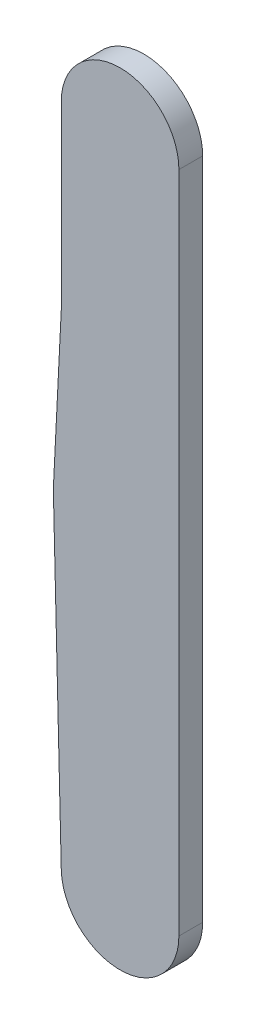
from build123d import *

# Parameters (mm, degrees)
EXTRUSION1_DEPTH = 15


with BuildPart() as part:
    # Esquisse1 → Extrusion1 (new body)
    with BuildSketch(Plane.XY):
        with BuildLine():
            Line((-37.13, 0), (-37.13, -114))
            Line((-37.13, -114), (-42.13, -214))
            Line((-42.13, -214), (-37.119009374, -419.903351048))
            ThreePointArc((-37.119009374, -419.903351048), (0.451708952, -456.127252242), (37.13, -419))
            Line((37.13, -419), (37.13, 0))
            ThreePointArc((37.13, 0), (0, 37.13), (-37.13, 0))
        make_face()
    extrude(amount=EXTRUSION1_DEPTH)


solid = part.part
